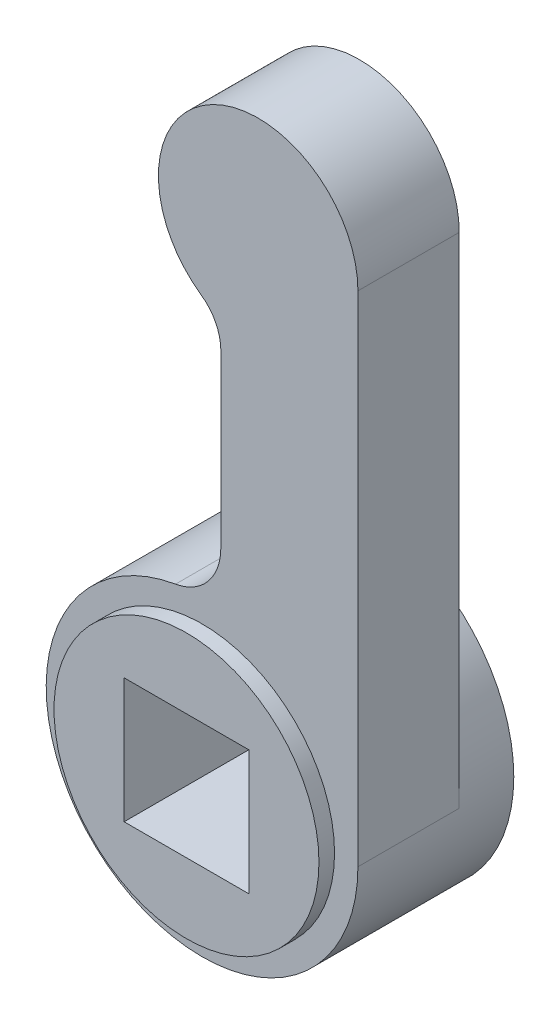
from build123d import *

# Parameters (mm, degrees)
SKIZZE1_R                    = 10
SKIZZE1_W                    = 8
SKIZZE1_H                    = 8
LINEAR_AUSTRAGEN1_DEPTH      = 5
LINEAR_AUSTRAGEN4_DEPTH      = 5
LINEAR_AUSTRAGEN4_DEPTH_BACK = 1.5
SKIZZE3_R                    = 8.5
SKIZZE3_W                    = 8
SKIZZE3_H                    = 8
LINEAR_AUSTRAGEN5_DEPTH      = 6


with BuildPart() as part:
    # Skizze1 → Linear austragen1 (new, symmetric)
    with BuildSketch(Plane.XY):
        Circle(SKIZZE1_R)
        Rectangle(SKIZZE1_W, SKIZZE1_H, mode=Mode.SUBTRACT)
    extrude(amount=LINEAR_AUSTRAGEN1_DEPTH, both=True)

    # Skizze2 → Linear austragen4 (add, two sides: drawn at the far end of the back side and taken through both)
    with BuildSketch(Plane.XY.offset(-LINEAR_AUSTRAGEN4_DEPTH_BACK)):
        with BuildLine():
            Line((10, 0), (10, 32))
            ThreePointArc((10, 32), (0.646543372, 37.677771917), (-0.074091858, 26.759670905))
            ThreePointArc((-0.074091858, 26.759670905), (0.86513317, 25.687699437), (1.203677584, 24.303266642))
            Line((1.203677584, 24.303266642), (1.203677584, 13.303266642))
            ThreePointArc((1.203677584, 13.303266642), (0.380774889, 11.04868242), (-1.700979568, 9.854271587))
            ThreePointArc((-1.700979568, 9.854271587), (6.441669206, 7.648849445), (10, 0))
        make_face()
    extrude(amount=LINEAR_AUSTRAGEN4_DEPTH + LINEAR_AUSTRAGEN4_DEPTH_BACK)

    # Skizze3 → Linear austragen5 (add, symmetric)
    with BuildSketch(Plane.XY):
        Circle(SKIZZE3_R)
        Rectangle(SKIZZE3_W, SKIZZE3_H, mode=Mode.SUBTRACT)
    extrude(amount=LINEAR_AUSTRAGEN5_DEPTH, both=True)


solid = part.part
